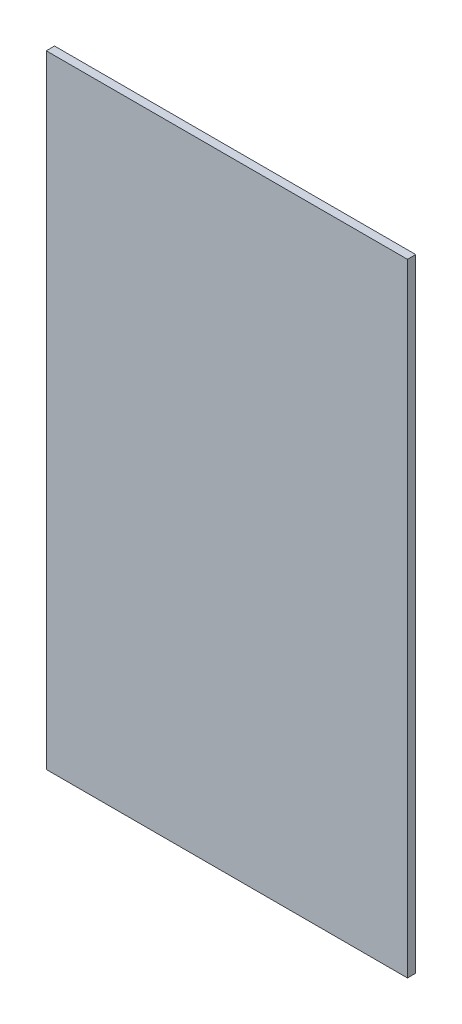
from build123d import *

# Parameters (mm, degrees)
SKETCH1_W           = 692.79999997
SKETCH1_H           = 1193.8
BOSS_EXTRUDE1_DEPTH = 15.875


with BuildPart() as part:
    # Sketch1 → Boss-Extrude1 (new body)
    with BuildSketch(Plane.XY):
        with Locations((-406.399999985, 586.9)):
            Rectangle(SKETCH1_W, SKETCH1_H)
    extrude(amount=BOSS_EXTRUDE1_DEPTH)


solid = part.part
